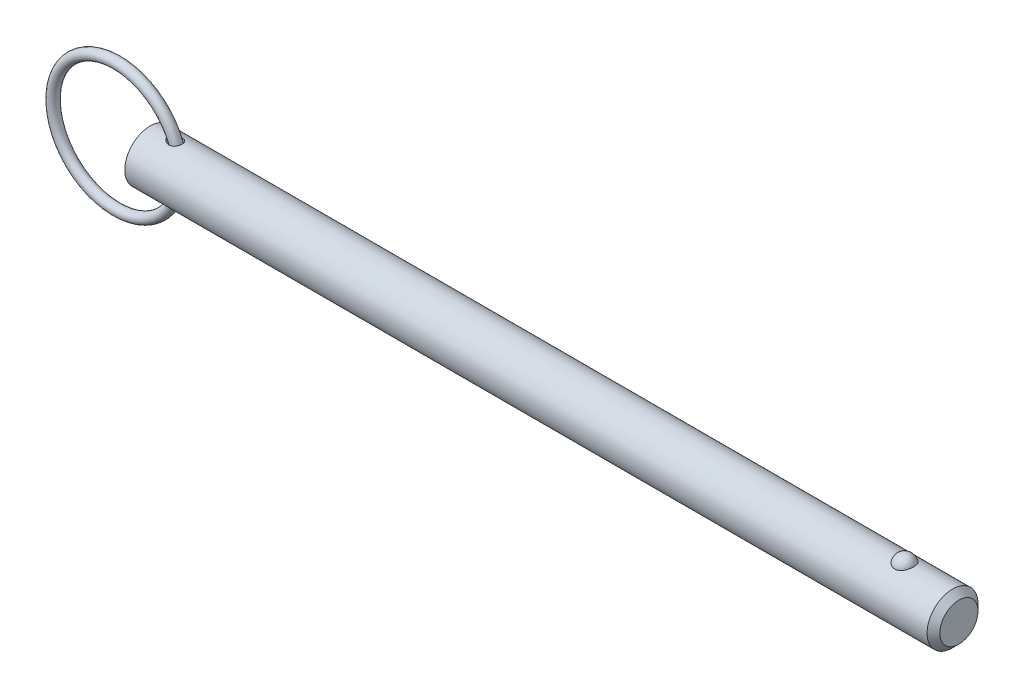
ISO-10303-21;
HEADER;
FILE_DESCRIPTION(('STEP AP214'),'2;1');
FILE_NAME('part.step','',(''),(''),'','','');
FILE_SCHEMA(('AUTOMOTIVE_DESIGN { 1 0 10303 214 1 1 1 1 }'));
ENDSEC;
DATA;
#1=APPLICATION_CONTEXT('core data for automotive mechanical design processes');
#2=APPLICATION_PROTOCOL_DEFINITION('international standard','automotive_design',2000,#1);
#3=PRODUCT_CONTEXT('',#1,'mechanical');
#4=PRODUCT('Part','Part','',(#3));
#5=PRODUCT_RELATED_PRODUCT_CATEGORY('part','',(#4));
#6=PRODUCT_DEFINITION_FORMATION('','',#4);
#7=PRODUCT_DEFINITION_CONTEXT('part definition',#1,'design');
#8=PRODUCT_DEFINITION('design','',#6,#7);
#9=PRODUCT_DEFINITION_SHAPE('','',#8);
#10=(LENGTH_UNIT() NAMED_UNIT(*) SI_UNIT(.MILLI.,.METRE.));
#11=(NAMED_UNIT(*) PLANE_ANGLE_UNIT() SI_UNIT($,.RADIAN.));
#12=(NAMED_UNIT(*) SI_UNIT($,.STERADIAN.) SOLID_ANGLE_UNIT());
#13=UNCERTAINTY_MEASURE_WITH_UNIT(LENGTH_MEASURE(1.E-05),#10,'distance_accuracy_value','');
#14=(GEOMETRIC_REPRESENTATION_CONTEXT(3) GLOBAL_UNCERTAINTY_ASSIGNED_CONTEXT((#13)) GLOBAL_UNIT_ASSIGNED_CONTEXT((#10,
#11,#12)) REPRESENTATION_CONTEXT('',''));
#15=CARTESIAN_POINT('',(0.,0.,0.));
#16=DIRECTION('',(0.,0.,1.));
#17=DIRECTION('',(1.,0.,0.));
#18=AXIS2_PLACEMENT_3D('',#15,#16,#17);
#19=CARTESIAN_POINT('',(-8.34703434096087,0.,0.));
#20=DIRECTION('',(0.,0.,1.));
#21=DIRECTION('',(1.,0.,0.));
#22=AXIS2_PLACEMENT_3D('',#19,#20,#21);
#23=TOROIDAL_SURFACE('',#22,15.875,1.27);
#24=CARTESIAN_POINT('',(8.79796565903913,0.,0.));
#25=VERTEX_POINT('',#24);
#26=VERTEX_LOOP('',#25);
#27=FACE_BOUND('',#26,.T.);
#28=ADVANCED_FACE('P0_F12',(#27),#23,.T.);
#29=CLOSED_SHELL('',(#28));
#30=MANIFOLD_SOLID_BREP('P0_B1',#29);
#31=CARTESIAN_POINT('',(0.,0.,0.));
#32=DIRECTION('',(1.,0.,0.));
#33=DIRECTION('',(0.,0.,-1.));
#34=AXIS2_PLACEMENT_3D('',#31,#32,#33);
#35=CYLINDRICAL_SURFACE('',#34,6.35);
#36=CARTESIAN_POINT('',(4.87230670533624,6.27273159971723,-0.987592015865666));
#37=CARTESIAN_POINT('',(4.94734735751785,6.26035058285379,-1.06623378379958));
#38=CARTESIAN_POINT('',(5.02968768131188,6.24755813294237,-1.13788608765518));
#39=CARTESIAN_POINT('',(5.20534267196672,6.22278258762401,-1.26640223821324));
#40=CARTESIAN_POINT('',(5.29867273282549,6.21080066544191,-1.32324497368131));
#41=CARTESIAN_POINT('',(5.49318962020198,6.18912414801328,-1.42117930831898));
#42=CARTESIAN_POINT('',(5.59435470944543,6.17942350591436,-1.46231273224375));
#43=CARTESIAN_POINT('',(5.80219659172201,6.16352555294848,-1.52793951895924));
#44=CARTESIAN_POINT('',(5.90887152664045,6.15732706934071,-1.55243845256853));
#45=CARTESIAN_POINT('',(6.12818220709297,6.14931784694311,-1.58387975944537));
#46=CARTESIAN_POINT('',(6.24090110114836,6.14763959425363,-1.59029227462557));
#47=CARTESIAN_POINT('',(6.46560233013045,6.14965588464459,-1.58248630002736));
#48=CARTESIAN_POINT('',(6.57758514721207,6.15334646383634,-1.56828303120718));
#49=CARTESIAN_POINT('',(6.78516594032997,6.1652116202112,-1.52091398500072));
#50=CARTESIAN_POINT('',(6.88126802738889,6.17288876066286,-1.48983713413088));
#51=CARTESIAN_POINT('',(7.06576629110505,6.19149190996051,-1.41052329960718));
#52=CARTESIAN_POINT('',(7.15416739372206,6.20241582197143,-1.36229738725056));
#53=CARTESIAN_POINT('',(7.3116692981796,6.2248616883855,-1.25548983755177));
#54=CARTESIAN_POINT('',(7.38181442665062,6.23621734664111,-1.19840625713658));
#55=CARTESIAN_POINT('',(7.51101296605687,6.259037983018,-1.07284763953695));
#56=CARTESIAN_POINT('',(7.5700684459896,6.2705029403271,-1.00437473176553));
#57=CARTESIAN_POINT('',(7.67374693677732,6.29184873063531,-0.860384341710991));
#58=CARTESIAN_POINT('',(7.71876694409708,6.30176816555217,-0.785157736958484));
#59=CARTESIAN_POINT('',(7.79574491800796,6.31935829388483,-0.628053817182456));
#60=CARTESIAN_POINT('',(7.82770308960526,6.32702902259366,-0.546176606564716));
#61=CARTESIAN_POINT('',(7.87788845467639,6.33930929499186,-0.377876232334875));
#62=CARTESIAN_POINT('',(7.8960810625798,6.34391112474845,-0.291442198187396));
#63=CARTESIAN_POINT('',(7.91820729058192,6.34953044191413,-0.116652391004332));
#64=CARTESIAN_POINT('',(7.92214044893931,6.35054781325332,-0.0282965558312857));
#65=CARTESIAN_POINT('',(7.91564686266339,6.34888556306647,0.14826357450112));
#66=CARTESIAN_POINT('',(7.9051533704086,6.34618875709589,0.236465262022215));
#67=CARTESIAN_POINT('',(7.86991530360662,6.33735741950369,0.409798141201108));
#68=CARTESIAN_POINT('',(7.84517062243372,6.33122286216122,0.494929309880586));
#69=CARTESIAN_POINT('',(7.78199851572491,6.31618517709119,0.659657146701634));
#70=CARTESIAN_POINT('',(7.74357645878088,6.30728313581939,0.739255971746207));
#71=CARTESIAN_POINT('',(7.65396632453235,6.28769050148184,0.890663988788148));
#72=CARTESIAN_POINT('',(7.60277911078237,6.27700002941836,0.962473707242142));
#73=CARTESIAN_POINT('',(7.48925881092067,6.2550822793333,1.09590260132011));
#74=CARTESIAN_POINT('',(7.42698604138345,6.24385813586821,1.15757361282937));
#75=CARTESIAN_POINT('',(7.29283556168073,6.2220655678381,1.26951234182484));
#76=CARTESIAN_POINT('',(7.22095880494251,6.21149707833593,1.31978118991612));
#77=CARTESIAN_POINT('',(7.06971853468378,6.19216002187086,1.40772509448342));
#78=CARTESIAN_POINT('',(6.99035873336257,6.18339056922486,1.44540635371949));
#79=CARTESIAN_POINT('',(6.826427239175,6.16851603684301,1.50762653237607));
#80=CARTESIAN_POINT('',(6.74185489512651,6.16241129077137,1.53216380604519));
#81=CARTESIAN_POINT('',(6.56686412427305,6.15321474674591,1.56869994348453));
#82=CARTESIAN_POINT('',(6.47634467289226,6.15023369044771,1.58023897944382));
#83=CARTESIAN_POINT('',(6.29456956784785,6.14778331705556,1.58974172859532));
#84=CARTESIAN_POINT('',(6.20331368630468,6.1483151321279,1.58770106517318));
#85=CARTESIAN_POINT('',(6.01385969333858,6.15284811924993,1.5700487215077));
#86=CARTESIAN_POINT('',(5.91578322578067,6.15715979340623,1.55322212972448));
#87=CARTESIAN_POINT('',(5.72331909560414,6.16902415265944,1.5054032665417));
#88=CARTESIAN_POINT('',(5.62893440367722,6.17657939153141,1.4743998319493));
#89=CARTESIAN_POINT('',(5.43572606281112,6.19502494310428,1.39499475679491));
#90=CARTESIAN_POINT('',(5.33755891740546,6.20619097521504,1.3450526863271));
#91=CARTESIAN_POINT('',(5.15090047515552,6.23006191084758,1.22975103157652));
#92=CARTESIAN_POINT('',(5.06240741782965,6.24276653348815,1.16439425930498));
#93=CARTESIAN_POINT('',(4.91171642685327,6.26607433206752,1.03083814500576));
#94=CARTESIAN_POINT('',(4.84758224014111,6.27668356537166,0.964825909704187));
#95=CARTESIAN_POINT('',(4.73090054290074,6.29683133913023,0.823112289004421));
#96=CARTESIAN_POINT('',(4.6783368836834,6.30637136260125,0.747424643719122));
#97=CARTESIAN_POINT('',(4.59543145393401,6.32183254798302,0.601150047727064));
#98=CARTESIAN_POINT('',(4.56283099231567,6.32809321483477,0.531883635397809));
#99=CARTESIAN_POINT('',(4.50941370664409,6.33849198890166,0.388778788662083));
#100=CARTESIAN_POINT('',(4.48858876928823,6.34263155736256,0.314943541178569));
#101=CARTESIAN_POINT('',(4.46008864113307,6.3483236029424,0.164282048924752));
#102=CARTESIAN_POINT('',(4.45247558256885,6.34986385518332,0.0874434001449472));
#103=CARTESIAN_POINT('',(4.45121096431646,6.35011863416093,-0.0663538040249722));
#104=CARTESIAN_POINT('',(4.45755802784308,6.34883343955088,-0.143312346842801));
#105=CARTESIAN_POINT('',(4.48267656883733,6.34380948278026,-0.288945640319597));
#106=CARTESIAN_POINT('',(4.50045680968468,6.34026665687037,-0.357802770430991));
#107=CARTESIAN_POINT('',(4.54636050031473,6.33128211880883,-0.49181574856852));
#108=CARTESIAN_POINT('',(4.57448566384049,6.32584009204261,-0.556970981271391));
#109=CARTESIAN_POINT('',(4.64209700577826,6.31308107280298,-0.687092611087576));
#110=CARTESIAN_POINT('',(4.68226903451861,6.30565525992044,-0.75168940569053));
#111=CARTESIAN_POINT('',(4.77120834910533,6.28979741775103,-0.874524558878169));
#112=CARTESIAN_POINT('',(4.81998302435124,6.28136452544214,-0.932757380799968));
#113=CARTESIAN_POINT('',(4.87230670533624,6.27273159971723,-0.987592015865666));
#114=B_SPLINE_CURVE_WITH_KNOTS('',3,(#36,#37,#38,#39,#40,#41,#42,#43,#44,#45,#46,#47,#48,#49,
#50,#51,#52,#53,#54,#55,#56,#57,#58,#59,#60,#61,#62,#63,#64,#65,#66,#67,#68,#69,#70,#71,#72,#73,
#74,#75,#76,#77,#78,#79,#80,#81,#82,#83,#84,#85,#86,#87,#88,#89,#90,#91,#92,#93,#94,#95,#96,#97,
#98,#99,#100,#101,#102,#103,#104,#105,#106,#107,#108,#109,#110,#111,#112,#113),.UNSPECIFIED.,
.T.,.F.,(4,2,2,2,2,2,2,2,2,2,2,2,2,2,2,2,2,2,2,2,2,2,2,2,2,2,2,2,2,2,2,2,2,2,2,2,2,2,4),(0.,
0.327902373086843,0.65626964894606,0.98375647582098,1.31113357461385,1.64800657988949,
1.98463099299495,2.28681225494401,2.58879878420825,2.86088594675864,3.13292229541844,
3.39636481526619,3.65980320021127,3.92390128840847,4.18800792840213,4.45334062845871,
4.7186753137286,4.98390596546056,5.24911867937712,5.51293017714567,5.7767155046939,
6.04037065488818,6.30405880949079,6.57680801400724,6.84964512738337,7.14724526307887,
7.44508014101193,7.77572668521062,8.10631295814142,8.38318772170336,8.65967357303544,
8.8891530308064,9.11847418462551,9.34887088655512,9.57924486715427,9.79193291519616,
10.0046562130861,10.2330958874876,10.4617327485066),.UNSPECIFIED.);
#115=CARTESIAN_POINT('',(4.87230670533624,6.27273159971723,-0.987592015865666));
#116=VERTEX_POINT('',#115);
#117=EDGE_CURVE('P1_E40',#116,#116,#114,.T.);
#118=ORIENTED_EDGE('',*,*,#117,.T.);
#119=EDGE_LOOP('',(#118));
#120=FACE_BOUND('',#119,.T.);
#121=CARTESIAN_POINT('',(200.0125,0.,0.));
#122=DIRECTION('',(1.,0.,0.));
#123=DIRECTION('',(0.,0.,-1.));
#124=AXIS2_PLACEMENT_3D('',#121,#122,#123);
#125=CIRCLE('',#124,6.35);
#126=CARTESIAN_POINT('',(200.0125,0.,-6.35));
#127=VERTEX_POINT('',#126);
#128=EDGE_CURVE('P1_E25',#127,#127,#125,.T.);
#129=ORIENTED_EDGE('',*,*,#128,.F.);
#130=EDGE_LOOP('',(#129));
#131=FACE_BOUND('',#130,.T.);
#132=CARTESIAN_POINT('',(0.,0.,0.));
#133=DIRECTION('',(1.,0.,0.));
#134=DIRECTION('',(0.,0.,-1.));
#135=AXIS2_PLACEMENT_3D('',#132,#133,#134);
#136=CIRCLE('',#135,6.35);
#137=CARTESIAN_POINT('',(0.,0.,-6.35));
#138=VERTEX_POINT('',#137);
#139=EDGE_CURVE('P1_E9',#138,#138,#136,.T.);
#140=ORIENTED_EDGE('',*,*,#139,.T.);
#141=EDGE_LOOP('',(#140));
#142=FACE_BOUND('',#141,.T.);
#143=CARTESIAN_POINT('',(188.050021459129,5.87502187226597,2.40969251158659));
#144=CARTESIAN_POINT('',(187.925030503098,5.87501645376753,2.40969773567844));
#145=CARTESIAN_POINT('',(187.800080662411,5.87916061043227,2.39967292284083));
#146=CARTESIAN_POINT('',(187.553909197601,5.8952311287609,2.35991730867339));
#147=CARTESIAN_POINT('',(187.432686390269,5.90715499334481,2.33019283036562));
#148=CARTESIAN_POINT('',(187.197517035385,5.93739567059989,2.25201402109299));
#149=CARTESIAN_POINT('',(187.083560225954,5.95570321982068,2.20358681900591));
#150=CARTESIAN_POINT('',(186.86557352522,5.99672067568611,2.08937987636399));
#151=CARTESIAN_POINT('',(186.761545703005,6.01943149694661,2.02359652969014));
#152=CARTESIAN_POINT('',(186.562943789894,6.06760647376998,1.87428969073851));
#153=CARTESIAN_POINT('',(186.468726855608,6.09313095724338,1.79031110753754));
#154=CARTESIAN_POINT('',(186.295255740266,6.14375873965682,1.60800178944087));
#155=CARTESIAN_POINT('',(186.216004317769,6.16886196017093,1.50966841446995));
#156=CARTESIAN_POINT('',(186.070845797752,6.21724600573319,1.29645884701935));
#157=CARTESIAN_POINT('',(186.005688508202,6.24039621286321,1.18104158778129));
#158=CARTESIAN_POINT('',(185.894703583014,6.28117277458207,0.940351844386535));
#159=CARTESIAN_POINT('',(185.848877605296,6.29879865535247,0.815078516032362));
#160=CARTESIAN_POINT('',(185.777023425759,6.32692073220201,0.556494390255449));
#161=CARTESIAN_POINT('',(185.751249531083,6.33732517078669,0.42310277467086));
#162=CARTESIAN_POINT('',(185.720988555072,6.34957673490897,0.153542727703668));
#163=CARTESIAN_POINT('',(185.716500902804,6.35142408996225,0.0173743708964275));
#164=CARTESIAN_POINT('',(185.728865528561,6.34638925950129,-0.253036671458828));
#165=CARTESIAN_POINT('',(185.745594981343,6.33955731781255,-0.387285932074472));
#166=CARTESIAN_POINT('',(185.799843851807,6.31794129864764,-0.650851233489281));
#167=CARTESIAN_POINT('',(185.837363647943,6.30315707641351,-0.7801671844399));
#168=CARTESIAN_POINT('',(185.932500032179,6.26711642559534,-1.03041949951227));
#169=CARTESIAN_POINT('',(185.990143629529,6.24585130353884,-1.1513443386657));
#170=CARTESIAN_POINT('',(186.124352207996,6.19905619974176,-1.38129800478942));
#171=CARTESIAN_POINT('',(186.200918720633,6.17352587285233,-1.49032586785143));
#172=CARTESIAN_POINT('',(186.371753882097,6.12080227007,-1.69393164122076));
#173=CARTESIAN_POINT('',(186.466100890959,6.09360200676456,-1.78844209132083));
#174=CARTESIAN_POINT('',(186.670119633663,6.04070434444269,-1.95970536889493));
#175=CARTESIAN_POINT('',(186.779790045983,6.01500681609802,-2.03645972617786));
#176=CARTESIAN_POINT('',(187.009187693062,5.96867714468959,-2.16845644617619));
#177=CARTESIAN_POINT('',(187.128652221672,5.94794910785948,-2.22412062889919));
#178=CARTESIAN_POINT('',(187.376218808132,5.91340580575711,-2.31440992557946));
#179=CARTESIAN_POINT('',(187.504317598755,5.8995879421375,-2.3490429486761));
#180=CARTESIAN_POINT('',(187.758582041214,5.88111049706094,-2.39491590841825));
#181=CARTESIAN_POINT('',(187.884520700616,5.876025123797,-2.40724512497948));
#182=CARTESIAN_POINT('',(188.136786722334,5.87428980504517,-2.41147867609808));
#183=CARTESIAN_POINT('',(188.263114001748,5.87763817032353,-2.40338710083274));
#184=CARTESIAN_POINT('',(188.508417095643,5.89212921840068,-2.36762715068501));
#185=CARTESIAN_POINT('',(188.627499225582,5.90302431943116,-2.34058030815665));
#186=CARTESIAN_POINT('',(188.85924472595,5.93113752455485,-2.26839066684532));
#187=CARTESIAN_POINT('',(188.971907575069,5.94835614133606,-2.22324640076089));
#188=CARTESIAN_POINT('',(189.190400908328,5.98773016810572,-2.11493806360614));
#189=CARTESIAN_POINT('',(189.296028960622,6.00998499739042,-2.05140269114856));
#190=CARTESIAN_POINT('',(189.495300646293,6.05690144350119,-1.90842705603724));
#191=CARTESIAN_POINT('',(189.588941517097,6.08156361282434,-1.82898313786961));
#192=CARTESIAN_POINT('',(189.766675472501,6.13211715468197,-1.65182429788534));
#193=CARTESIAN_POINT('',(189.850055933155,6.15800825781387,-1.55339381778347));
#194=CARTESIAN_POINT('',(189.999790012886,6.20712834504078,-1.34374214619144));
#195=CARTESIAN_POINT('',(190.066140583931,6.23035685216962,-1.23251867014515));
#196=CARTESIAN_POINT('',(190.182345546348,6.27251177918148,-0.996447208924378));
#197=CARTESIAN_POINT('',(190.231607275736,6.29127762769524,-0.871278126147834));
#198=CARTESIAN_POINT('',(190.309614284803,6.3215862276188,-0.613870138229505));
#199=CARTESIAN_POINT('',(190.338359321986,6.33312889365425,-0.481631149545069));
#200=CARTESIAN_POINT('',(190.37477058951,6.34782349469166,-0.213672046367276));
#201=CARTESIAN_POINT('',(190.382413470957,6.35096613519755,-0.0779482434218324));
#202=CARTESIAN_POINT('',(190.376395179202,6.34851322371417,0.192943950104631));
#203=CARTESIAN_POINT('',(190.362734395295,6.3429178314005,0.328112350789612));
#204=CARTESIAN_POINT('',(190.31450361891,6.32360512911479,0.593406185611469));
#205=CARTESIAN_POINT('',(190.280031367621,6.30992579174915,0.723552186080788));
#206=CARTESIAN_POINT('',(190.190953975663,6.27586325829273,0.975834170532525));
#207=CARTESIAN_POINT('',(190.13634761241,6.25547965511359,1.0979696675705));
#208=CARTESIAN_POINT('',(190.00775879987,6.20998183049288,1.33148921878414));
#209=CARTESIAN_POINT('',(189.933674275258,6.18484288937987,1.44281227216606));
#210=CARTESIAN_POINT('',(189.767820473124,6.13258735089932,1.65087683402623));
#211=CARTESIAN_POINT('',(189.676051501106,6.10547078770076,1.74761859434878));
#212=CARTESIAN_POINT('',(189.477183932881,6.05235879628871,1.92350926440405));
#213=CARTESIAN_POINT('',(189.370133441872,6.02636017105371,2.00271146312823));
#214=CARTESIAN_POINT('',(189.143138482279,5.97843747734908,2.1415415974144));
#215=CARTESIAN_POINT('',(189.023191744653,5.95651412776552,2.20116608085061));
#216=CARTESIAN_POINT('',(188.764523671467,5.91812106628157,2.30250570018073));
#217=CARTESIAN_POINT('',(188.62506980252,5.90217533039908,2.34256795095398));
#218=CARTESIAN_POINT('',(188.340397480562,5.88063128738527,2.39615214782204));
#219=CARTESIAN_POINT('',(188.19518174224,5.8750281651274,2.40968644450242));
#220=CARTESIAN_POINT('',(188.050021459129,5.87502187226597,2.40969251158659));
#221=B_SPLINE_CURVE_WITH_KNOTS('',3,(#143,#144,#145,#146,#147,#148,#149,#150,#151,#152,#153,
#154,#155,#156,#157,#158,#159,#160,#161,#162,#163,#164,#165,#166,#167,#168,#169,#170,#171,#172,
#173,#174,#175,#176,#177,#178,#179,#180,#181,#182,#183,#184,#185,#186,#187,#188,#189,#190,#191,
#192,#193,#194,#195,#196,#197,#198,#199,#200,#201,#202,#203,#204,#205,#206,#207,#208,#209,#210,
#211,#212,#213,#214,#215,#216,#217,#218,#219,#220),.UNSPECIFIED.,.T.,.F.,(4,2,2,2,2,2,2,2,2,2,2,
2,2,2,2,2,2,2,2,2,2,2,2,2,2,2,2,2,2,2,2,2,2,2,2,2,2,2,4),(0.,0.374440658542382,
0.748761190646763,1.12254078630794,1.49639810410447,1.88098871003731,2.2656501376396,
2.66741104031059,3.06920639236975,3.47601794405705,3.88281858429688,4.28727498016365,
4.69173873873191,5.09674745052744,5.50178895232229,5.90865911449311,6.31549420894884,
6.71369855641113,7.11175305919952,7.48978077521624,7.86773278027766,8.2338388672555,
8.59997464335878,8.97409044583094,9.34829231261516,9.74122667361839,10.1342313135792,
10.5397522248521,10.9452779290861,11.3512521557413,11.7572189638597,12.1612938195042,
12.5653932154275,12.9716540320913,13.3779078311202,13.7829098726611,14.1879832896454,
14.6230486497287,15.0579114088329),.UNSPECIFIED.);
#222=CARTESIAN_POINT('',(188.050021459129,5.87502187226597,2.40969251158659));
#223=VERTEX_POINT('',#222);
#224=EDGE_CURVE('P1_E34',#223,#223,#221,.T.);
#225=ORIENTED_EDGE('',*,*,#224,.T.);
#226=EDGE_LOOP('',(#225));
#227=FACE_BOUND('',#226,.T.);
#228=CARTESIAN_POINT('',(4.87230670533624,-6.27273159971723,-0.987592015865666));
#229=CARTESIAN_POINT('',(4.81440819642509,-6.28228431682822,-0.926913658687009));
#230=CARTESIAN_POINT('',(4.76085022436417,-6.29159289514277,-0.862071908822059));
#231=CARTESIAN_POINT('',(4.66448472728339,-6.3088950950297,-0.724655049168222));
#232=CARTESIAN_POINT('',(4.62166818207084,-6.31688981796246,-0.652086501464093));
#233=CARTESIAN_POINT('',(4.54882773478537,-6.33076917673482,-0.499747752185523));
#234=CARTESIAN_POINT('',(4.51891553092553,-6.33663532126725,-0.419921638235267));
#235=CARTESIAN_POINT('',(4.4747692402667,-6.3453711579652,-0.255882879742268));
#236=CARTESIAN_POINT('',(4.4605188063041,-6.34824397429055,-0.171674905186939));
#237=CARTESIAN_POINT('',(4.44966179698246,-6.35043041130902,-0.012076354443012));
#238=CARTESIAN_POINT('',(4.45117530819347,-6.35012328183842,0.063184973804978));
#239=CARTESIAN_POINT('',(4.46726452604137,-6.34689000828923,0.212230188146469));
#240=CARTESIAN_POINT('',(4.48184026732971,-6.3439638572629,0.286014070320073));
#241=CARTESIAN_POINT('',(4.52202068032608,-6.33603071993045,0.426550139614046));
#242=CARTESIAN_POINT('',(4.54707079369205,-6.33112875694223,0.493469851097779));
#243=CARTESIAN_POINT('',(4.60669855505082,-6.31972370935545,0.622743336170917));
#244=CARTESIAN_POINT('',(4.64127887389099,-6.31322017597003,0.685095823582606));
#245=CARTESIAN_POINT('',(4.7232814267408,-6.29826068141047,0.811769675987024));
#246=CARTESIAN_POINT('',(4.77176118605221,-6.28966287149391,0.87538636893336));
#247=CARTESIAN_POINT('',(4.87703902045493,-6.27182325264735,0.995192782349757));
#248=CARTESIAN_POINT('',(4.93384225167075,-6.26258104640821,1.05137785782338));
#249=CARTESIAN_POINT('',(5.06617436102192,-6.24228878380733,1.16635591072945));
#250=CARTESIAN_POINT('',(5.14318167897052,-6.23124423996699,1.22345054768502));
#251=CARTESIAN_POINT('',(5.3047576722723,-6.21023402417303,1.32598441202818));
#252=CARTESIAN_POINT('',(5.38933237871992,-6.20026922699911,1.37141422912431));
#253=CARTESIAN_POINT('',(5.57760134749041,-6.18099350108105,1.45601817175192));
#254=CARTESIAN_POINT('',(5.68224348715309,-6.17201456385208,1.4931788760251));
#255=CARTESIAN_POINT('',(5.89649087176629,-6.15800474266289,1.5499484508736));
#256=CARTESIAN_POINT('',(6.00609708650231,-6.15297463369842,1.56955387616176));
#257=CARTESIAN_POINT('',(6.22752772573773,-6.14779725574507,1.58971993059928));
#258=CARTESIAN_POINT('',(6.33935715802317,-6.14766266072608,1.59023112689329));
#259=CARTESIAN_POINT('',(6.56108231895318,-6.15269227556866,1.57066564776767));
#260=CARTESIAN_POINT('',(6.67097982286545,-6.15785133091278,1.55060899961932));
#261=CARTESIAN_POINT('',(6.87257705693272,-6.17211580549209,1.4927326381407));
#262=CARTESIAN_POINT('',(6.96494608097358,-6.18072242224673,1.45711948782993));
#263=CARTESIAN_POINT('',(7.14129343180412,-6.20069920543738,1.36960980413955));
#264=CARTESIAN_POINT('',(7.22527609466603,-6.21206793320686,1.31772174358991));
#265=CARTESIAN_POINT('',(7.37471505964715,-6.23497047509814,1.20443359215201));
#266=CARTESIAN_POINT('',(7.44115811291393,-6.24639757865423,1.14430788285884));
#267=CARTESIAN_POINT('',(7.56261868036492,-6.26896339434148,1.0134084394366));
#268=CARTESIAN_POINT('',(7.61763801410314,-6.28010215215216,0.942636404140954));
#269=CARTESIAN_POINT('',(7.71360563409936,-6.30055923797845,0.794304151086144));
#270=CARTESIAN_POINT('',(7.75485562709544,-6.3099143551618,0.716943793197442));
#271=CARTESIAN_POINT('',(7.82406051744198,-6.32610528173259,0.556244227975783));
#272=CARTESIAN_POINT('',(7.85201540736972,-6.33294108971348,0.472905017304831));
#273=CARTESIAN_POINT('',(7.89408663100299,-6.34338077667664,0.302249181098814));
#274=CARTESIAN_POINT('',(7.90814615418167,-6.34697138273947,0.214917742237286));
#275=CARTESIAN_POINT('',(7.92192329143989,-6.35048887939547,0.0390564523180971));
#276=CARTESIAN_POINT('',(7.92164046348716,-6.3504156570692,-0.0494734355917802));
#277=CARTESIAN_POINT('',(7.9067075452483,-6.34660520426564,-0.225592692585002));
#278=CARTESIAN_POINT('',(7.89199989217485,-6.34285329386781,-0.313176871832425));
#279=CARTESIAN_POINT('',(7.84845340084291,-6.33206809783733,-0.484549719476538));
#280=CARTESIAN_POINT('',(7.8196145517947,-6.32503480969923,-0.568338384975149));
#281=CARTESIAN_POINT('',(7.74850591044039,-6.30846389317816,-0.729625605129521));
#282=CARTESIAN_POINT('',(7.70625193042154,-6.29892921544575,-0.807131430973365));
#283=CARTESIAN_POINT('',(7.60933437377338,-6.27840608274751,-0.953731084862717));
#284=CARTESIAN_POINT('',(7.55467181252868,-6.2674177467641,-1.02282560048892));
#285=CARTESIAN_POINT('',(7.43471786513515,-6.24527869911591,-1.15028913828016));
#286=CARTESIAN_POINT('',(7.36948829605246,-6.23412925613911,-1.20871657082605));
#287=CARTESIAN_POINT('',(7.23001723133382,-6.21283678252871,-1.3137894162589));
#288=CARTESIAN_POINT('',(7.15577649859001,-6.20269366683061,-1.36043582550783));
#289=CARTESIAN_POINT('',(7.00025986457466,-6.18446636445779,-1.44103993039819));
#290=CARTESIAN_POINT('',(6.91896776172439,-6.17638709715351,-1.47496739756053));
#291=CARTESIAN_POINT('',(6.75184232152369,-6.16309237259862,-1.52957024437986));
#292=CARTESIAN_POINT('',(6.6660081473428,-6.15787744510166,-1.55024317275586));
#293=CARTESIAN_POINT('',(6.48842585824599,-6.15055064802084,-1.57906962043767));
#294=CARTESIAN_POINT('',(6.39658108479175,-6.14857915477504,-1.58665744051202));
#295=CARTESIAN_POINT('',(6.21279832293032,-6.14817707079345,-1.58821048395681));
#296=CARTESIAN_POINT('',(6.12086031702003,-6.14974736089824,-1.58217231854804));
#297=CARTESIAN_POINT('',(5.92996902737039,-6.15640095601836,-1.55609403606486));
#298=CARTESIAN_POINT('',(5.83120653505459,-6.16181208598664,-1.53474519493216));
#299=CARTESIAN_POINT('',(5.63804881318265,-6.17573474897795,-1.47771859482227));
#300=CARTESIAN_POINT('',(5.54365953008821,-6.18425037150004,-1.44202192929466));
#301=CARTESIAN_POINT('',(5.34413923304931,-6.20522938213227,-1.34918979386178));
#302=CARTESIAN_POINT('',(5.24033140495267,-6.21813417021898,-1.28928337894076));
#303=CARTESIAN_POINT('',(5.0455423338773,-6.24510162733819,-1.15156760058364));
#304=CARTESIAN_POINT('',(4.95454590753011,-6.25916289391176,-1.07377972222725));
#305=CARTESIAN_POINT('',(4.87230670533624,-6.27273159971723,-0.987592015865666));
#306=B_SPLINE_CURVE_WITH_KNOTS('',3,(#228,#229,#230,#231,#232,#233,#234,#235,#236,#237,#238,
#239,#240,#241,#242,#243,#244,#245,#246,#247,#248,#249,#250,#251,#252,#253,#254,#255,#256,#257,
#258,#259,#260,#261,#262,#263,#264,#265,#266,#267,#268,#269,#270,#271,#272,#273,#274,#275,#276,
#277,#278,#279,#280,#281,#282,#283,#284,#285,#286,#287,#288,#289,#290,#291,#292,#293,#294,#295,
#296,#297,#298,#299,#300,#301,#302,#303,#304,#305),.UNSPECIFIED.,.T.,.F.,(4,2,2,2,2,2,2,2,2,2,2,
2,2,2,2,2,2,2,2,2,2,2,2,2,2,2,2,2,2,2,2,2,2,2,2,2,2,2,4),(0.,0.252951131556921,0.50568912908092,
0.760572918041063,1.01519041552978,1.23982791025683,1.46446600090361,1.67847364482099,
1.89254132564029,2.13299551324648,2.37359928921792,2.6619896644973,2.95061196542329,
3.28329078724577,3.61603488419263,3.94964035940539,4.282921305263,4.57939201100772,
4.87570862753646,5.14538810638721,5.4150245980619,5.67829123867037,5.94155802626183,
6.20589676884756,6.47024365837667,6.73564974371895,7.00105603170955,7.26615064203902,
7.53122356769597,7.79479837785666,8.05835088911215,8.32252586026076,8.58674967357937,
8.86213419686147,9.137587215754,9.43991696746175,9.74264642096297,10.1023688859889,
10.461661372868),.UNSPECIFIED.);
#307=CARTESIAN_POINT('',(4.87230670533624,-6.27273159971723,-0.987592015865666));
#308=VERTEX_POINT('',#307);
#309=EDGE_CURVE('P1_E17',#308,#308,#306,.T.);
#310=ORIENTED_EDGE('',*,*,#309,.T.);
#311=EDGE_LOOP('',(#310));
#312=FACE_BOUND('',#311,.T.);
#313=ADVANCED_FACE('P1_F13',(#120,#131,#142,#227,#312),#35,.T.);
#314=CARTESIAN_POINT('',(0.,0.,0.));
#315=DIRECTION('',(-1.,0.,0.));
#316=DIRECTION('',(0.,0.,1.));
#317=AXIS2_PLACEMENT_3D('',#314,#315,#316);
#318=PLANE('',#317);
#319=ORIENTED_EDGE('',*,*,#139,.F.);
#320=EDGE_LOOP('',(#319));
#321=FACE_BOUND('',#320,.T.);
#322=ADVANCED_FACE('P1_F15',(#321),#318,.T.);
#323=CARTESIAN_POINT('',(201.6,0.,0.));
#324=DIRECTION('',(-1.,0.,0.));
#325=DIRECTION('',(0.,0.,1.));
#326=AXIS2_PLACEMENT_3D('',#323,#324,#325);
#327=CONICAL_SURFACE('',#326,4.76250000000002,0.785398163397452);
#328=ORIENTED_EDGE('',*,*,#128,.T.);
#329=EDGE_LOOP('',(#328));
#330=FACE_BOUND('',#329,.T.);
#331=CARTESIAN_POINT('',(201.6,0.,0.));
#332=DIRECTION('',(1.,0.,0.));
#333=DIRECTION('',(0.,0.,-1.));
#334=AXIS2_PLACEMENT_3D('',#331,#332,#333);
#335=CIRCLE('',#334,4.76250000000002);
#336=CARTESIAN_POINT('',(201.6,0.,-4.76250000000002));
#337=VERTEX_POINT('',#336);
#338=EDGE_CURVE('P1_E30',#337,#337,#335,.T.);
#339=ORIENTED_EDGE('',*,*,#338,.F.);
#340=EDGE_LOOP('',(#339));
#341=FACE_BOUND('',#340,.T.);
#342=ADVANCED_FACE('P1_F55',(#330,#341),#327,.T.);
#343=CARTESIAN_POINT('',(201.6,4.76250000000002,0.));
#344=DIRECTION('',(1.,0.,0.));
#345=DIRECTION('',(0.,0.,-1.));
#346=AXIS2_PLACEMENT_3D('',#343,#344,#345);
#347=PLANE('',#346);
#348=ORIENTED_EDGE('',*,*,#338,.T.);
#349=EDGE_LOOP('',(#348));
#350=FACE_BOUND('',#349,.T.);
#351=ADVANCED_FACE('P1_F51',(#350),#347,.T.);
#352=CARTESIAN_POINT('',(188.050021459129,5.715,0.));
#353=DIRECTION('',(-1.,0.,0.));
#354=DIRECTION('',(0.,1.,0.));
#355=AXIS2_PLACEMENT_3D('',#352,#353,#354);
#356=SPHERICAL_SURFACE('',#355,2.415);
#357=ORIENTED_EDGE('',*,*,#224,.F.);
#358=EDGE_LOOP('',(#357));
#359=FACE_BOUND('',#358,.T.);
#360=ADVANCED_FACE('P1_F46',(#359),#356,.T.);
#361=CARTESIAN_POINT('',(-8.34703434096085,0.,0.));
#362=DIRECTION('',(0.,0.,1.));
#363=DIRECTION('',(1.,0.,0.));
#364=AXIS2_PLACEMENT_3D('',#361,#362,#363);
#365=TOROIDAL_SURFACE('',#364,15.875,1.5875);
#366=ORIENTED_EDGE('',*,*,#309,.F.);
#367=EDGE_LOOP('',(#366));
#368=FACE_BOUND('',#367,.T.);
#369=ORIENTED_EDGE('',*,*,#117,.F.);
#370=EDGE_LOOP('',(#369));
#371=FACE_BOUND('',#370,.T.);
#372=ADVANCED_FACE('P1_F50',(#368,#371),#365,.F.);
#373=CLOSED_SHELL('',(#313,#322,#342,#351,#360,#372));
#374=MANIFOLD_SOLID_BREP('P1_B1',#373);
#375=ADVANCED_BREP_SHAPE_REPRESENTATION('',(#18,#30,#374),#14);
#376=SHAPE_DEFINITION_REPRESENTATION(#9,#375);
ENDSEC;
END-ISO-10303-21;
